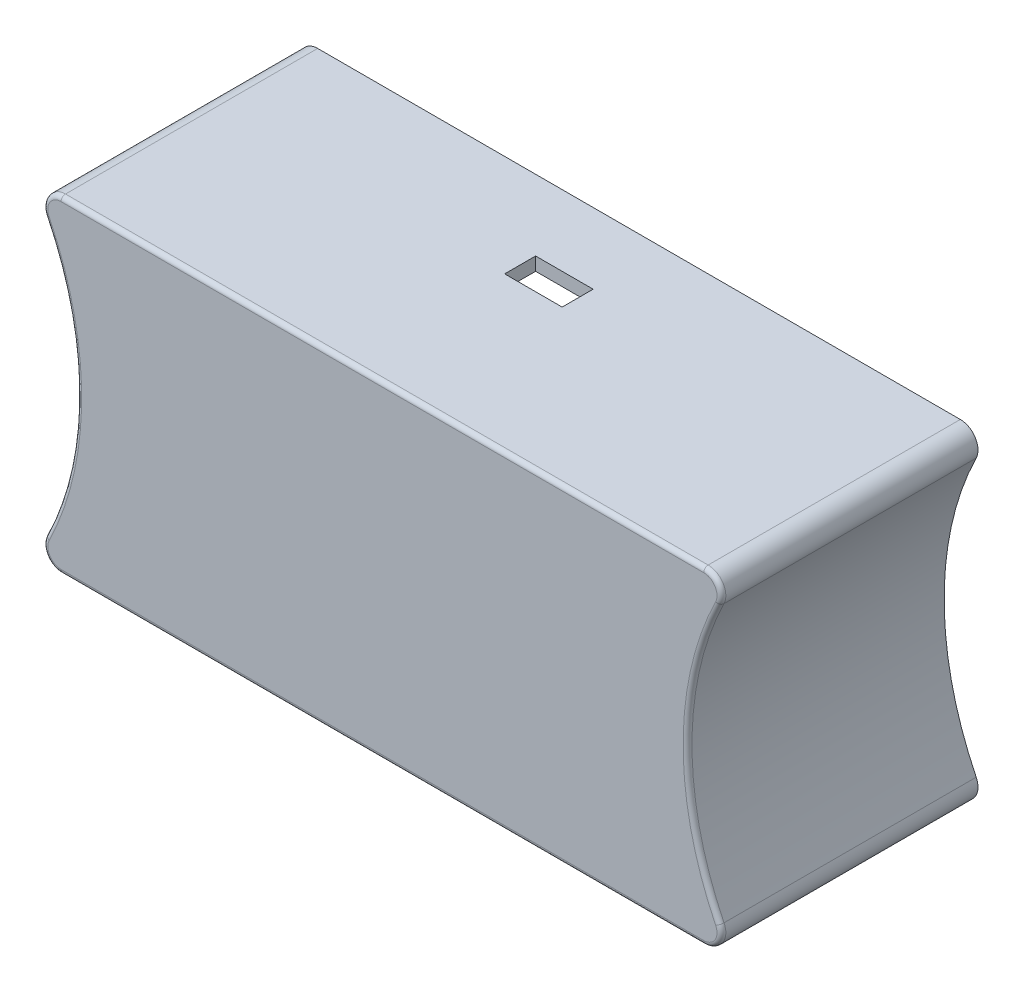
ISO-10303-21;
HEADER;
FILE_DESCRIPTION(('STEP AP214'),'2;1');
FILE_NAME('part.step','',(''),(''),'','','');
FILE_SCHEMA(('AUTOMOTIVE_DESIGN { 1 0 10303 214 1 1 1 1 }'));
ENDSEC;
DATA;
#1=APPLICATION_CONTEXT('core data for automotive mechanical design processes');
#2=APPLICATION_PROTOCOL_DEFINITION('international standard','automotive_design',2000,#1);
#3=PRODUCT_CONTEXT('',#1,'mechanical');
#4=PRODUCT('Part','Part','',(#3));
#5=PRODUCT_RELATED_PRODUCT_CATEGORY('part','',(#4));
#6=PRODUCT_DEFINITION_FORMATION('','',#4);
#7=PRODUCT_DEFINITION_CONTEXT('part definition',#1,'design');
#8=PRODUCT_DEFINITION('design','',#6,#7);
#9=PRODUCT_DEFINITION_SHAPE('','',#8);
#10=(LENGTH_UNIT() NAMED_UNIT(*) SI_UNIT(.MILLI.,.METRE.));
#11=(NAMED_UNIT(*) PLANE_ANGLE_UNIT() SI_UNIT($,.RADIAN.));
#12=(NAMED_UNIT(*) SI_UNIT($,.STERADIAN.) SOLID_ANGLE_UNIT());
#13=UNCERTAINTY_MEASURE_WITH_UNIT(LENGTH_MEASURE(1.E-05),#10,'distance_accuracy_value','');
#14=(GEOMETRIC_REPRESENTATION_CONTEXT(3) GLOBAL_UNCERTAINTY_ASSIGNED_CONTEXT((#13)) GLOBAL_UNIT_ASSIGNED_CONTEXT((#10,
#11,#12)) REPRESENTATION_CONTEXT('',''));
#15=CARTESIAN_POINT('',(0.,0.,0.));
#16=DIRECTION('',(0.,0.,1.));
#17=DIRECTION('',(1.,0.,0.));
#18=AXIS2_PLACEMENT_3D('',#15,#16,#17);
#19=CARTESIAN_POINT('',(72.6340015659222,37.,3.));
#20=DIRECTION('',(0.,-1.,0.));
#21=DIRECTION('',(0.,0.,-1.));
#22=AXIS2_PLACEMENT_3D('',#19,#20,#21);
#23=PLANE('',#22);
#24=DIRECTION('',(-1.,0.,0.));
#25=VECTOR('',#24,1.);
#26=CARTESIAN_POINT('',(5.63400156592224,37.,-39.));
#27=LINE('',#26,#25);
#28=CARTESIAN_POINT('',(5.63400156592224,37.,-39.));
#29=VERTEX_POINT('',#28);
#30=CARTESIAN_POINT('',(-7.36599843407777,37.,-39.));
#31=VERTEX_POINT('',#30);
#32=EDGE_CURVE('E217',#29,#31,#27,.T.);
#33=ORIENTED_EDGE('',*,*,#32,.F.);
#34=DIRECTION('',(0.,0.,-1.));
#35=VECTOR('',#34,1.);
#36=CARTESIAN_POINT('',(5.63400156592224,37.,-32.));
#37=LINE('',#36,#35);
#38=CARTESIAN_POINT('',(5.63400156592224,37.,-32.));
#39=VERTEX_POINT('',#38);
#40=EDGE_CURVE('E59',#39,#29,#37,.T.);
#41=ORIENTED_EDGE('',*,*,#40,.F.);
#42=DIRECTION('',(1.,0.,0.));
#43=VECTOR('',#42,1.);
#44=CARTESIAN_POINT('',(-7.36599843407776,37.,-32.));
#45=LINE('',#44,#43);
#46=CARTESIAN_POINT('',(-7.36599843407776,37.,-32.));
#47=VERTEX_POINT('',#46);
#48=EDGE_CURVE('E224',#47,#39,#45,.T.);
#49=ORIENTED_EDGE('',*,*,#48,.F.);
#50=DIRECTION('',(0.,0.,1.));
#51=VECTOR('',#50,1.);
#52=CARTESIAN_POINT('',(-7.36599843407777,37.,-39.));
#53=LINE('',#52,#51);
#54=EDGE_CURVE('E207',#31,#47,#53,.T.);
#55=ORIENTED_EDGE('',*,*,#54,.F.);
#56=EDGE_LOOP('',(#33,#41,#49,#55));
#57=FACE_BOUND('',#56,.T.);
#58=DIRECTION('',(0.,0.,-1.));
#59=VECTOR('',#58,1.);
#60=CARTESIAN_POINT('',(-72.6340015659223,37.,3.));
#61=LINE('',#60,#59);
#62=CARTESIAN_POINT('',(-72.6340015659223,37.,2.));
#63=VERTEX_POINT('',#62);
#64=CARTESIAN_POINT('',(-72.6340015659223,37.,-55.));
#65=VERTEX_POINT('',#64);
#66=EDGE_CURVE('E376',#63,#65,#61,.T.);
#67=ORIENTED_EDGE('',*,*,#66,.F.);
#68=DIRECTION('',(-1.,0.,0.));
#69=VECTOR('',#68,1.);
#70=CARTESIAN_POINT('',(72.6340015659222,37.,2.));
#71=LINE('',#70,#69);
#72=CARTESIAN_POINT('',(72.6340015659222,37.,2.));
#73=VERTEX_POINT('',#72);
#74=EDGE_CURVE('E426',#63,#73,#71,.F.);
#75=ORIENTED_EDGE('',*,*,#74,.T.);
#76=DIRECTION('',(0.,0.,-1.));
#77=VECTOR('',#76,1.);
#78=CARTESIAN_POINT('',(72.6340015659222,37.,3.));
#79=LINE('',#78,#77);
#80=CARTESIAN_POINT('',(72.6340015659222,37.,-55.));
#81=VERTEX_POINT('',#80);
#82=EDGE_CURVE('E355',#73,#81,#79,.T.);
#83=ORIENTED_EDGE('',*,*,#82,.T.);
#84=DIRECTION('',(-1.,0.,0.));
#85=VECTOR('',#84,1.);
#86=CARTESIAN_POINT('',(72.6340015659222,37.,-55.));
#87=LINE('',#86,#85);
#88=EDGE_CURVE('E247',#81,#65,#87,.T.);
#89=ORIENTED_EDGE('',*,*,#88,.T.);
#90=EDGE_LOOP('',(#67,#75,#83,#89));
#91=FACE_BOUND('',#90,.T.);
#92=ADVANCED_FACE('F43',(#57,#91),#23,.F.);
#93=CARTESIAN_POINT('',(-72.6340015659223,33.,3.));
#94=DIRECTION('',(0.,0.,-1.));
#95=DIRECTION('',(-1.,0.,0.));
#96=AXIS2_PLACEMENT_3D('',#93,#94,#95);
#97=CYLINDRICAL_SURFACE('',#96,3.99999999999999);
#98=DIRECTION('',(0.,0.,-1.));
#99=VECTOR('',#98,1.);
#100=CARTESIAN_POINT('',(-76.2253313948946,31.2386510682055,3.));
#101=LINE('',#100,#99);
#102=CARTESIAN_POINT('',(-76.2253313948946,31.2386510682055,2.));
#103=VERTEX_POINT('',#102);
#104=CARTESIAN_POINT('',(-76.2253313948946,31.2386510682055,-55.));
#105=VERTEX_POINT('',#104);
#106=EDGE_CURVE('E373',#103,#105,#101,.T.);
#107=ORIENTED_EDGE('',*,*,#106,.F.);
#108=CARTESIAN_POINT('',(-72.6340015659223,33.,2.));
#109=DIRECTION('',(0.,0.,1.));
#110=DIRECTION('',(1.,0.,0.));
#111=AXIS2_PLACEMENT_3D('',#108,#109,#110);
#112=CIRCLE('',#111,3.99999999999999);
#113=EDGE_CURVE('E423',#103,#63,#112,.F.);
#114=ORIENTED_EDGE('',*,*,#113,.T.);
#115=ORIENTED_EDGE('',*,*,#66,.T.);
#116=CARTESIAN_POINT('',(-72.6340015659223,33.,-55.));
#117=DIRECTION('',(0.,0.,1.));
#118=DIRECTION('',(1.,0.,0.));
#119=AXIS2_PLACEMENT_3D('',#116,#117,#118);
#120=CIRCLE('',#119,3.99999999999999);
#121=EDGE_CURVE('E327',#65,#105,#120,.T.);
#122=ORIENTED_EDGE('',*,*,#121,.T.);
#123=EDGE_LOOP('',(#107,#114,#115,#122));
#124=FACE_BOUND('',#123,.T.);
#125=ADVANCED_FACE('F486',(#124),#97,.T.);
#126=CARTESIAN_POINT('',(-139.919865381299,0.,3.));
#127=DIRECTION('',(0.,0.,-1.));
#128=DIRECTION('',(-1.,0.,0.));
#129=AXIS2_PLACEMENT_3D('',#126,#127,#128);
#130=CYLINDRICAL_SURFACE('',#129,70.942561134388);
#131=DIRECTION('',(0.,0.,-1.));
#132=VECTOR('',#131,1.);
#133=CARTESIAN_POINT('',(-76.2253313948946,-31.2386510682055,3.));
#134=LINE('',#133,#132);
#135=CARTESIAN_POINT('',(-76.2253313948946,-31.2386510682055,2.));
#136=VERTEX_POINT('',#135);
#137=CARTESIAN_POINT('',(-76.2253313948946,-31.2386510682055,-55.));
#138=VERTEX_POINT('',#137);
#139=EDGE_CURVE('E370',#136,#138,#134,.T.);
#140=ORIENTED_EDGE('',*,*,#139,.F.);
#141=CARTESIAN_POINT('',(-139.919865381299,0.,2.));
#142=DIRECTION('',(0.,0.,1.));
#143=DIRECTION('',(1.,0.,0.));
#144=AXIS2_PLACEMENT_3D('',#141,#142,#143);
#145=CIRCLE('',#144,70.942561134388);
#146=EDGE_CURVE('E420',#136,#103,#145,.T.);
#147=ORIENTED_EDGE('',*,*,#146,.T.);
#148=ORIENTED_EDGE('',*,*,#106,.T.);
#149=CARTESIAN_POINT('',(-139.919865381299,0.,-55.));
#150=DIRECTION('',(0.,0.,1.));
#151=DIRECTION('',(1.,0.,0.));
#152=AXIS2_PLACEMENT_3D('',#149,#150,#151);
#153=CIRCLE('',#152,70.942561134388);
#154=EDGE_CURVE('E331',#138,#105,#153,.T.);
#155=ORIENTED_EDGE('',*,*,#154,.F.);
#156=EDGE_LOOP('',(#140,#147,#148,#155));
#157=FACE_BOUND('',#156,.T.);
#158=ADVANCED_FACE('F491',(#157),#130,.F.);
#159=CARTESIAN_POINT('',(-72.6340015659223,-33.,3.));
#160=DIRECTION('',(0.,0.,-1.));
#161=DIRECTION('',(-1.,0.,0.));
#162=AXIS2_PLACEMENT_3D('',#159,#160,#161);
#163=CYLINDRICAL_SURFACE('',#162,3.99999999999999);
#164=DIRECTION('',(0.,0.,-1.));
#165=VECTOR('',#164,1.);
#166=CARTESIAN_POINT('',(-72.6340015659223,-37.,3.));
#167=LINE('',#166,#165);
#168=CARTESIAN_POINT('',(-72.6340015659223,-37.,2.));
#169=VERTEX_POINT('',#168);
#170=CARTESIAN_POINT('',(-72.6340015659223,-37.,-55.));
#171=VERTEX_POINT('',#170);
#172=EDGE_CURVE('E367',#169,#171,#167,.T.);
#173=ORIENTED_EDGE('',*,*,#172,.F.);
#174=CARTESIAN_POINT('',(-72.6340015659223,-33.,2.));
#175=DIRECTION('',(0.,0.,1.));
#176=DIRECTION('',(1.,0.,0.));
#177=AXIS2_PLACEMENT_3D('',#174,#175,#176);
#178=CIRCLE('',#177,3.99999999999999);
#179=EDGE_CURVE('E417',#169,#136,#178,.F.);
#180=ORIENTED_EDGE('',*,*,#179,.T.);
#181=ORIENTED_EDGE('',*,*,#139,.T.);
#182=CARTESIAN_POINT('',(-72.6340015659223,-33.,-55.));
#183=DIRECTION('',(0.,0.,1.));
#184=DIRECTION('',(1.,0.,0.));
#185=AXIS2_PLACEMENT_3D('',#182,#183,#184);
#186=CIRCLE('',#185,3.99999999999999);
#187=EDGE_CURVE('E335',#138,#171,#186,.T.);
#188=ORIENTED_EDGE('',*,*,#187,.T.);
#189=EDGE_LOOP('',(#173,#180,#181,#188));
#190=FACE_BOUND('',#189,.T.);
#191=ADVANCED_FACE('F533',(#190),#163,.T.);
#192=CARTESIAN_POINT('',(-72.6340015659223,-37.,3.));
#193=DIRECTION('',(0.,1.,0.));
#194=DIRECTION('',(0.,0.,1.));
#195=AXIS2_PLACEMENT_3D('',#192,#193,#194);
#196=PLANE('',#195);
#197=DIRECTION('',(0.,0.,-1.));
#198=VECTOR('',#197,1.);
#199=CARTESIAN_POINT('',(72.6340015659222,-37.,3.));
#200=LINE('',#199,#198);
#201=CARTESIAN_POINT('',(72.6340015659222,-37.,2.));
#202=VERTEX_POINT('',#201);
#203=CARTESIAN_POINT('',(72.6340015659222,-37.,-55.));
#204=VERTEX_POINT('',#203);
#205=EDGE_CURVE('E364',#202,#204,#200,.T.);
#206=ORIENTED_EDGE('',*,*,#205,.F.);
#207=DIRECTION('',(1.,0.,0.));
#208=VECTOR('',#207,1.);
#209=CARTESIAN_POINT('',(-72.6340015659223,-37.,2.));
#210=LINE('',#209,#208);
#211=EDGE_CURVE('E414',#202,#169,#210,.F.);
#212=ORIENTED_EDGE('',*,*,#211,.T.);
#213=ORIENTED_EDGE('',*,*,#172,.T.);
#214=DIRECTION('',(1.,0.,0.));
#215=VECTOR('',#214,1.);
#216=CARTESIAN_POINT('',(-72.6340015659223,-37.,-55.));
#217=LINE('',#216,#215);
#218=EDGE_CURVE('E339',#171,#204,#217,.T.);
#219=ORIENTED_EDGE('',*,*,#218,.T.);
#220=EDGE_LOOP('',(#206,#212,#213,#219));
#221=FACE_BOUND('',#220,.T.);
#222=ADVANCED_FACE('F546',(#221),#196,.F.);
#223=CARTESIAN_POINT('',(72.6340015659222,-33.,3.));
#224=DIRECTION('',(0.,0.,-1.));
#225=DIRECTION('',(-1.,0.,0.));
#226=AXIS2_PLACEMENT_3D('',#223,#224,#225);
#227=CYLINDRICAL_SURFACE('',#226,4.);
#228=DIRECTION('',(0.,0.,-1.));
#229=VECTOR('',#228,1.);
#230=CARTESIAN_POINT('',(76.2253313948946,-31.2386510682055,3.));
#231=LINE('',#230,#229);
#232=CARTESIAN_POINT('',(76.2253313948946,-31.2386510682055,2.));
#233=VERTEX_POINT('',#232);
#234=CARTESIAN_POINT('',(76.2253313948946,-31.2386510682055,-55.));
#235=VERTEX_POINT('',#234);
#236=EDGE_CURVE('E361',#233,#235,#231,.T.);
#237=ORIENTED_EDGE('',*,*,#236,.F.);
#238=CARTESIAN_POINT('',(72.6340015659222,-33.,2.));
#239=DIRECTION('',(0.,0.,1.));
#240=DIRECTION('',(1.,0.,0.));
#241=AXIS2_PLACEMENT_3D('',#238,#239,#240);
#242=CIRCLE('',#241,4.);
#243=EDGE_CURVE('E411',#233,#202,#242,.F.);
#244=ORIENTED_EDGE('',*,*,#243,.T.);
#245=ORIENTED_EDGE('',*,*,#205,.T.);
#246=CARTESIAN_POINT('',(72.6340015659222,-33.,-55.));
#247=DIRECTION('',(0.,0.,1.));
#248=DIRECTION('',(1.,0.,0.));
#249=AXIS2_PLACEMENT_3D('',#246,#247,#248);
#250=CIRCLE('',#249,4.);
#251=EDGE_CURVE('E343',#204,#235,#250,.T.);
#252=ORIENTED_EDGE('',*,*,#251,.T.);
#253=EDGE_LOOP('',(#237,#244,#245,#252));
#254=FACE_BOUND('',#253,.T.);
#255=ADVANCED_FACE('F549',(#254),#227,.T.);
#256=CARTESIAN_POINT('',(139.919865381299,0.,3.));
#257=DIRECTION('',(0.,0.,-1.));
#258=DIRECTION('',(-1.,0.,0.));
#259=AXIS2_PLACEMENT_3D('',#256,#257,#258);
#260=CYLINDRICAL_SURFACE('',#259,70.942561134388);
#261=DIRECTION('',(0.,0.,-1.));
#262=VECTOR('',#261,1.);
#263=CARTESIAN_POINT('',(76.2253313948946,31.2386510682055,3.));
#264=LINE('',#263,#262);
#265=CARTESIAN_POINT('',(76.2253313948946,31.2386510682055,2.));
#266=VERTEX_POINT('',#265);
#267=CARTESIAN_POINT('',(76.2253313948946,31.2386510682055,-55.));
#268=VERTEX_POINT('',#267);
#269=EDGE_CURVE('E358',#266,#268,#264,.T.);
#270=ORIENTED_EDGE('',*,*,#269,.F.);
#271=CARTESIAN_POINT('',(139.919865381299,0.,2.));
#272=DIRECTION('',(0.,0.,1.));
#273=DIRECTION('',(1.,0.,0.));
#274=AXIS2_PLACEMENT_3D('',#271,#272,#273);
#275=CIRCLE('',#274,70.942561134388);
#276=EDGE_CURVE('E408',#266,#233,#275,.T.);
#277=ORIENTED_EDGE('',*,*,#276,.T.);
#278=ORIENTED_EDGE('',*,*,#236,.T.);
#279=CARTESIAN_POINT('',(139.919865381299,0.,-55.));
#280=DIRECTION('',(0.,0.,1.));
#281=DIRECTION('',(1.,0.,0.));
#282=AXIS2_PLACEMENT_3D('',#279,#280,#281);
#283=CIRCLE('',#282,70.942561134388);
#284=EDGE_CURVE('E347',#268,#235,#283,.T.);
#285=ORIENTED_EDGE('',*,*,#284,.F.);
#286=EDGE_LOOP('',(#270,#277,#278,#285));
#287=FACE_BOUND('',#286,.T.);
#288=ADVANCED_FACE('F574',(#287),#260,.F.);
#289=CARTESIAN_POINT('',(72.6340015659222,33.,3.));
#290=DIRECTION('',(0.,0.,-1.));
#291=DIRECTION('',(-1.,0.,0.));
#292=AXIS2_PLACEMENT_3D('',#289,#290,#291);
#293=CYLINDRICAL_SURFACE('',#292,4.);
#294=ORIENTED_EDGE('',*,*,#82,.F.);
#295=CARTESIAN_POINT('',(72.6340015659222,33.,2.));
#296=DIRECTION('',(0.,0.,1.));
#297=DIRECTION('',(1.,0.,0.));
#298=AXIS2_PLACEMENT_3D('',#295,#296,#297);
#299=CIRCLE('',#298,4.);
#300=EDGE_CURVE('E404',#73,#266,#299,.F.);
#301=ORIENTED_EDGE('',*,*,#300,.T.);
#302=ORIENTED_EDGE('',*,*,#269,.T.);
#303=CARTESIAN_POINT('',(72.6340015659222,33.,-55.));
#304=DIRECTION('',(0.,0.,1.));
#305=DIRECTION('',(1.,0.,0.));
#306=AXIS2_PLACEMENT_3D('',#303,#304,#305);
#307=CIRCLE('',#306,4.);
#308=EDGE_CURVE('E351',#268,#81,#307,.T.);
#309=ORIENTED_EDGE('',*,*,#308,.T.);
#310=EDGE_LOOP('',(#294,#301,#302,#309));
#311=FACE_BOUND('',#310,.T.);
#312=ADVANCED_FACE('F569',(#311),#293,.T.);
#313=CARTESIAN_POINT('',(-72.6340015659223,33.,3.));
#314=DIRECTION('',(0.,0.,1.));
#315=DIRECTION('',(1.,0.,0.));
#316=AXIS2_PLACEMENT_3D('',#313,#314,#315);
#317=PLANE('',#316);
#318=CARTESIAN_POINT('',(139.919865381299,0.,3.));
#319=DIRECTION('',(0.,0.,1.));
#320=DIRECTION('',(1.,0.,0.));
#321=AXIS2_PLACEMENT_3D('',#318,#319,#320);
#322=CIRCLE('',#321,71.942561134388);
#323=CARTESIAN_POINT('',(75.3274989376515,-31.6789883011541,3.));
#324=VERTEX_POINT('',#323);
#325=CARTESIAN_POINT('',(75.3274989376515,31.6789883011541,3.));
#326=VERTEX_POINT('',#325);
#327=EDGE_CURVE('E397',#324,#326,#322,.F.);
#328=ORIENTED_EDGE('',*,*,#327,.T.);
#329=CARTESIAN_POINT('',(72.6340015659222,33.,3.));
#330=DIRECTION('',(0.,0.,1.));
#331=DIRECTION('',(1.,0.,0.));
#332=AXIS2_PLACEMENT_3D('',#329,#330,#331);
#333=CIRCLE('',#332,3.);
#334=CARTESIAN_POINT('',(72.6340015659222,36.,3.));
#335=VERTEX_POINT('',#334);
#336=EDGE_CURVE('E400',#326,#335,#333,.T.);
#337=ORIENTED_EDGE('',*,*,#336,.T.);
#338=DIRECTION('',(-1.,0.,0.));
#339=VECTOR('',#338,1.);
#340=CARTESIAN_POINT('',(-72.6340015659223,36.,3.));
#341=LINE('',#340,#339);
#342=CARTESIAN_POINT('',(-72.6340015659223,36.,3.));
#343=VERTEX_POINT('',#342);
#344=EDGE_CURVE('E379',#335,#343,#341,.T.);
#345=ORIENTED_EDGE('',*,*,#344,.T.);
#346=CARTESIAN_POINT('',(-72.6340015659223,33.,3.));
#347=DIRECTION('',(0.,0.,1.));
#348=DIRECTION('',(1.,0.,0.));
#349=AXIS2_PLACEMENT_3D('',#346,#347,#348);
#350=CIRCLE('',#349,2.99999999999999);
#351=CARTESIAN_POINT('',(-75.3274989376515,31.6789883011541,3.));
#352=VERTEX_POINT('',#351);
#353=EDGE_CURVE('E382',#343,#352,#350,.T.);
#354=ORIENTED_EDGE('',*,*,#353,.T.);
#355=CARTESIAN_POINT('',(-139.919865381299,0.,3.));
#356=DIRECTION('',(0.,0.,1.));
#357=DIRECTION('',(1.,0.,0.));
#358=AXIS2_PLACEMENT_3D('',#355,#356,#357);
#359=CIRCLE('',#358,71.942561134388);
#360=CARTESIAN_POINT('',(-75.3274989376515,-31.6789883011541,3.));
#361=VERTEX_POINT('',#360);
#362=EDGE_CURVE('E385',#352,#361,#359,.F.);
#363=ORIENTED_EDGE('',*,*,#362,.T.);
#364=CARTESIAN_POINT('',(-72.6340015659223,-33.,3.));
#365=DIRECTION('',(0.,0.,1.));
#366=DIRECTION('',(1.,0.,0.));
#367=AXIS2_PLACEMENT_3D('',#364,#365,#366);
#368=CIRCLE('',#367,2.99999999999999);
#369=CARTESIAN_POINT('',(-72.6340015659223,-36.,3.));
#370=VERTEX_POINT('',#369);
#371=EDGE_CURVE('E388',#361,#370,#368,.T.);
#372=ORIENTED_EDGE('',*,*,#371,.T.);
#373=DIRECTION('',(1.,0.,0.));
#374=VECTOR('',#373,1.);
#375=CARTESIAN_POINT('',(72.6340015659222,-36.,3.));
#376=LINE('',#375,#374);
#377=CARTESIAN_POINT('',(72.6340015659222,-36.,3.));
#378=VERTEX_POINT('',#377);
#379=EDGE_CURVE('E391',#370,#378,#376,.T.);
#380=ORIENTED_EDGE('',*,*,#379,.T.);
#381=CARTESIAN_POINT('',(72.6340015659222,-33.,3.));
#382=DIRECTION('',(0.,0.,1.));
#383=DIRECTION('',(1.,0.,0.));
#384=AXIS2_PLACEMENT_3D('',#381,#382,#383);
#385=CIRCLE('',#384,3.);
#386=EDGE_CURVE('E394',#378,#324,#385,.T.);
#387=ORIENTED_EDGE('',*,*,#386,.T.);
#388=EDGE_LOOP('',(#328,#337,#345,#354,#363,#372,#380,#387));
#389=FACE_BOUND('',#388,.T.);
#390=ADVANCED_FACE('F558',(#389),#317,.T.);
#391=CARTESIAN_POINT('',(-72.6340015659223,33.,-55.));
#392=DIRECTION('',(0.,0.,1.));
#393=DIRECTION('',(1.,0.,0.));
#394=AXIS2_PLACEMENT_3D('',#391,#392,#393);
#395=PLANE('',#394);
#396=CARTESIAN_POINT('',(72.6340015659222,33.,-55.));
#397=DIRECTION('',(0.,0.,1.));
#398=DIRECTION('',(1.,0.,0.));
#399=AXIS2_PLACEMENT_3D('',#396,#397,#398);
#400=CIRCLE('',#399,1.);
#401=CARTESIAN_POINT('',(73.5318340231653,32.5596627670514,-55.));
#402=VERTEX_POINT('',#401);
#403=CARTESIAN_POINT('',(72.6340015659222,34.,-55.));
#404=VERTEX_POINT('',#403);
#405=EDGE_CURVE('E254',#402,#404,#400,.T.);
#406=ORIENTED_EDGE('',*,*,#405,.T.);
#407=DIRECTION('',(-1.,0.,0.));
#408=VECTOR('',#407,1.);
#409=CARTESIAN_POINT('',(72.6340015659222,34.,-55.));
#410=LINE('',#409,#408);
#411=CARTESIAN_POINT('',(-72.6340015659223,34.,-55.));
#412=VERTEX_POINT('',#411);
#413=EDGE_CURVE('E293',#404,#412,#410,.T.);
#414=ORIENTED_EDGE('',*,*,#413,.T.);
#415=CARTESIAN_POINT('',(-72.6340015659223,33.,-55.));
#416=DIRECTION('',(0.,0.,1.));
#417=DIRECTION('',(1.,0.,0.));
#418=AXIS2_PLACEMENT_3D('',#415,#416,#417);
#419=CIRCLE('',#418,0.999999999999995);
#420=CARTESIAN_POINT('',(-73.5318340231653,32.5596627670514,-55.));
#421=VERTEX_POINT('',#420);
#422=EDGE_CURVE('E297',#412,#421,#419,.T.);
#423=ORIENTED_EDGE('',*,*,#422,.T.);
#424=CARTESIAN_POINT('',(-139.919865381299,0.,-55.));
#425=DIRECTION('',(0.,0.,1.));
#426=DIRECTION('',(1.,0.,0.));
#427=AXIS2_PLACEMENT_3D('',#424,#425,#426);
#428=CIRCLE('',#427,73.942561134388);
#429=CARTESIAN_POINT('',(-73.5318340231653,-32.5596627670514,-55.));
#430=VERTEX_POINT('',#429);
#431=EDGE_CURVE('E318',#430,#421,#428,.T.);
#432=ORIENTED_EDGE('',*,*,#431,.F.);
#433=CARTESIAN_POINT('',(-72.6340015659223,-33.,-55.));
#434=DIRECTION('',(0.,0.,1.));
#435=DIRECTION('',(1.,0.,0.));
#436=AXIS2_PLACEMENT_3D('',#433,#434,#435);
#437=CIRCLE('',#436,0.999999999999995);
#438=CARTESIAN_POINT('',(-72.6340015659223,-34.,-55.));
#439=VERTEX_POINT('',#438);
#440=EDGE_CURVE('E314',#430,#439,#437,.T.);
#441=ORIENTED_EDGE('',*,*,#440,.T.);
#442=DIRECTION('',(1.,0.,0.));
#443=VECTOR('',#442,1.);
#444=CARTESIAN_POINT('',(-72.6340015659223,-34.,-55.));
#445=LINE('',#444,#443);
#446=CARTESIAN_POINT('',(72.6340015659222,-34.,-55.));
#447=VERTEX_POINT('',#446);
#448=EDGE_CURVE('E310',#439,#447,#445,.T.);
#449=ORIENTED_EDGE('',*,*,#448,.T.);
#450=CARTESIAN_POINT('',(72.6340015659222,-33.,-55.));
#451=DIRECTION('',(0.,0.,1.));
#452=DIRECTION('',(1.,0.,0.));
#453=AXIS2_PLACEMENT_3D('',#450,#451,#452);
#454=CIRCLE('',#453,0.999999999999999);
#455=CARTESIAN_POINT('',(73.5318340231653,-32.5596627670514,-55.));
#456=VERTEX_POINT('',#455);
#457=EDGE_CURVE('E306',#447,#456,#454,.T.);
#458=ORIENTED_EDGE('',*,*,#457,.T.);
#459=CARTESIAN_POINT('',(139.919865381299,0.,-55.));
#460=DIRECTION('',(0.,0.,1.));
#461=DIRECTION('',(1.,0.,0.));
#462=AXIS2_PLACEMENT_3D('',#459,#460,#461);
#463=CIRCLE('',#462,73.942561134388);
#464=EDGE_CURVE('E302',#402,#456,#463,.T.);
#465=ORIENTED_EDGE('',*,*,#464,.F.);
#466=EDGE_LOOP('',(#406,#414,#423,#432,#441,#449,#458,#465));
#467=FACE_BOUND('',#466,.T.);
#468=ORIENTED_EDGE('',*,*,#88,.F.);
#469=ORIENTED_EDGE('',*,*,#308,.F.);
#470=ORIENTED_EDGE('',*,*,#284,.T.);
#471=ORIENTED_EDGE('',*,*,#251,.F.);
#472=ORIENTED_EDGE('',*,*,#218,.F.);
#473=ORIENTED_EDGE('',*,*,#187,.F.);
#474=ORIENTED_EDGE('',*,*,#154,.T.);
#475=ORIENTED_EDGE('',*,*,#121,.F.);
#476=EDGE_LOOP('',(#468,#469,#470,#471,#472,#473,#474,#475));
#477=FACE_BOUND('',#476,.T.);
#478=ADVANCED_FACE('F542',(#467,#477),#395,.F.);
#479=CARTESIAN_POINT('',(72.6340015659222,34.,3.));
#480=DIRECTION('',(0.,-1.,0.));
#481=DIRECTION('',(0.,0.,-1.));
#482=AXIS2_PLACEMENT_3D('',#479,#480,#481);
#483=PLANE('',#482);
#484=DIRECTION('',(0.,0.,1.));
#485=VECTOR('',#484,1.);
#486=CARTESIAN_POINT('',(5.63400156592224,34.,3.00000000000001));
#487=LINE('',#486,#485);
#488=CARTESIAN_POINT('',(5.63400156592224,34.,-39.));
#489=VERTEX_POINT('',#488);
#490=CARTESIAN_POINT('',(5.63400156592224,34.,-32.));
#491=VERTEX_POINT('',#490);
#492=EDGE_CURVE('E11',#489,#491,#487,.T.);
#493=ORIENTED_EDGE('',*,*,#492,.F.);
#494=DIRECTION('',(1.,0.,0.));
#495=VECTOR('',#494,1.);
#496=CARTESIAN_POINT('',(72.6340015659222,34.,-39.));
#497=LINE('',#496,#495);
#498=CARTESIAN_POINT('',(-7.36599843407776,34.,-39.));
#499=VERTEX_POINT('',#498);
#500=EDGE_CURVE('E429',#499,#489,#497,.T.);
#501=ORIENTED_EDGE('',*,*,#500,.F.);
#502=DIRECTION('',(0.,0.,-1.));
#503=VECTOR('',#502,1.);
#504=CARTESIAN_POINT('',(-7.36599843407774,34.,3.00000000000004));
#505=LINE('',#504,#503);
#506=CARTESIAN_POINT('',(-7.36599843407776,34.,-32.));
#507=VERTEX_POINT('',#506);
#508=EDGE_CURVE('E210',#507,#499,#505,.T.);
#509=ORIENTED_EDGE('',*,*,#508,.F.);
#510=DIRECTION('',(-1.,0.,0.));
#511=VECTOR('',#510,1.);
#512=CARTESIAN_POINT('',(72.6340015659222,34.,-32.));
#513=LINE('',#512,#511);
#514=EDGE_CURVE('E52',#491,#507,#513,.T.);
#515=ORIENTED_EDGE('',*,*,#514,.F.);
#516=EDGE_LOOP('',(#493,#501,#509,#515));
#517=FACE_BOUND('',#516,.T.);
#518=DIRECTION('',(0.,0.,-1.));
#519=VECTOR('',#518,1.);
#520=CARTESIAN_POINT('',(72.6340015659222,34.,3.));
#521=LINE('',#520,#519);
#522=CARTESIAN_POINT('',(72.6340015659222,34.,0.));
#523=VERTEX_POINT('',#522);
#524=EDGE_CURVE('E239',#523,#404,#521,.T.);
#525=ORIENTED_EDGE('',*,*,#524,.F.);
#526=DIRECTION('',(-1.,0.,0.));
#527=VECTOR('',#526,1.);
#528=CARTESIAN_POINT('',(72.6340015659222,34.,0.));
#529=LINE('',#528,#527);
#530=CARTESIAN_POINT('',(-72.6340015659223,34.,0.));
#531=VERTEX_POINT('',#530);
#532=EDGE_CURVE('E249',#523,#531,#529,.T.);
#533=ORIENTED_EDGE('',*,*,#532,.T.);
#534=DIRECTION('',(0.,0.,-1.));
#535=VECTOR('',#534,1.);
#536=CARTESIAN_POINT('',(-72.6340015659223,34.,3.));
#537=LINE('',#536,#535);
#538=EDGE_CURVE('E244',#531,#412,#537,.T.);
#539=ORIENTED_EDGE('',*,*,#538,.T.);
#540=ORIENTED_EDGE('',*,*,#413,.F.);
#541=EDGE_LOOP('',(#525,#533,#539,#540));
#542=FACE_BOUND('',#541,.T.);
#543=ADVANCED_FACE('F468',(#517,#542),#483,.T.);
#544=CARTESIAN_POINT('',(-72.6340015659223,33.,3.));
#545=DIRECTION('',(0.,0.,-1.));
#546=DIRECTION('',(-1.,0.,0.));
#547=AXIS2_PLACEMENT_3D('',#544,#545,#546);
#548=CYLINDRICAL_SURFACE('',#547,0.999999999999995);
#549=ORIENTED_EDGE('',*,*,#538,.F.);
#550=CARTESIAN_POINT('',(-72.6340015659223,33.,0.));
#551=DIRECTION('',(0.,0.,1.));
#552=DIRECTION('',(1.,0.,0.));
#553=AXIS2_PLACEMENT_3D('',#550,#551,#552);
#554=CIRCLE('',#553,0.999999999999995);
#555=CARTESIAN_POINT('',(-73.5318340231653,32.5596627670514,0.));
#556=VERTEX_POINT('',#555);
#557=EDGE_CURVE('E253',#531,#556,#554,.T.);
#558=ORIENTED_EDGE('',*,*,#557,.T.);
#559=DIRECTION('',(0.,0.,-1.));
#560=VECTOR('',#559,1.);
#561=CARTESIAN_POINT('',(-73.5318340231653,32.5596627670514,3.));
#562=LINE('',#561,#560);
#563=EDGE_CURVE('E248',#556,#421,#562,.T.);
#564=ORIENTED_EDGE('',*,*,#563,.T.);
#565=ORIENTED_EDGE('',*,*,#422,.F.);
#566=EDGE_LOOP('',(#549,#558,#564,#565));
#567=FACE_BOUND('',#566,.T.);
#568=ADVANCED_FACE('F699',(#567),#548,.F.);
#569=CARTESIAN_POINT('',(-139.919865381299,0.,3.));
#570=DIRECTION('',(0.,0.,-1.));
#571=DIRECTION('',(-1.,0.,0.));
#572=AXIS2_PLACEMENT_3D('',#569,#570,#571);
#573=CYLINDRICAL_SURFACE('',#572,73.942561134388);
#574=ORIENTED_EDGE('',*,*,#563,.F.);
#575=CARTESIAN_POINT('',(-139.919865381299,0.,0.));
#576=DIRECTION('',(0.,0.,1.));
#577=DIRECTION('',(1.,0.,0.));
#578=AXIS2_PLACEMENT_3D('',#575,#576,#577);
#579=CIRCLE('',#578,73.942561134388);
#580=CARTESIAN_POINT('',(-73.5318340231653,-32.5596627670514,0.));
#581=VERTEX_POINT('',#580);
#582=EDGE_CURVE('E261',#581,#556,#579,.T.);
#583=ORIENTED_EDGE('',*,*,#582,.F.);
#584=DIRECTION('',(0.,0.,-1.));
#585=VECTOR('',#584,1.);
#586=CARTESIAN_POINT('',(-73.5318340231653,-32.5596627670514,3.));
#587=LINE('',#586,#585);
#588=EDGE_CURVE('E258',#581,#430,#587,.T.);
#589=ORIENTED_EDGE('',*,*,#588,.T.);
#590=ORIENTED_EDGE('',*,*,#431,.T.);
#591=EDGE_LOOP('',(#574,#583,#589,#590));
#592=FACE_BOUND('',#591,.T.);
#593=ADVANCED_FACE('F799',(#592),#573,.T.);
#594=CARTESIAN_POINT('',(-72.6340015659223,-33.,3.));
#595=DIRECTION('',(0.,0.,-1.));
#596=DIRECTION('',(-1.,0.,0.));
#597=AXIS2_PLACEMENT_3D('',#594,#595,#596);
#598=CYLINDRICAL_SURFACE('',#597,0.999999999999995);
#599=ORIENTED_EDGE('',*,*,#588,.F.);
#600=CARTESIAN_POINT('',(-72.6340015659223,-33.,0.));
#601=DIRECTION('',(0.,0.,1.));
#602=DIRECTION('',(1.,0.,0.));
#603=AXIS2_PLACEMENT_3D('',#600,#601,#602);
#604=CIRCLE('',#603,0.999999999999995);
#605=CARTESIAN_POINT('',(-72.6340015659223,-34.,0.));
#606=VERTEX_POINT('',#605);
#607=EDGE_CURVE('E268',#581,#606,#604,.T.);
#608=ORIENTED_EDGE('',*,*,#607,.T.);
#609=DIRECTION('',(0.,0.,1.));
#610=VECTOR('',#609,1.);
#611=CARTESIAN_POINT('',(-72.6340015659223,-34.,3.));
#612=LINE('',#611,#610);
#613=EDGE_CURVE('E264',#606,#439,#612,.F.);
#614=ORIENTED_EDGE('',*,*,#613,.T.);
#615=ORIENTED_EDGE('',*,*,#440,.F.);
#616=EDGE_LOOP('',(#599,#608,#614,#615));
#617=FACE_BOUND('',#616,.T.);
#618=ADVANCED_FACE('F789',(#617),#598,.F.);
#619=CARTESIAN_POINT('',(-72.6340015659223,-34.,3.));
#620=DIRECTION('',(0.,1.,0.));
#621=DIRECTION('',(0.,0.,1.));
#622=AXIS2_PLACEMENT_3D('',#619,#620,#621);
#623=PLANE('',#622);
#624=ORIENTED_EDGE('',*,*,#613,.F.);
#625=DIRECTION('',(1.,0.,0.));
#626=VECTOR('',#625,1.);
#627=CARTESIAN_POINT('',(-72.6340015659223,-34.,0.));
#628=LINE('',#627,#626);
#629=CARTESIAN_POINT('',(72.6340015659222,-34.,0.));
#630=VERTEX_POINT('',#629);
#631=EDGE_CURVE('E274',#606,#630,#628,.T.);
#632=ORIENTED_EDGE('',*,*,#631,.T.);
#633=DIRECTION('',(0.,0.,-1.));
#634=VECTOR('',#633,1.);
#635=CARTESIAN_POINT('',(72.6340015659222,-34.,3.));
#636=LINE('',#635,#634);
#637=EDGE_CURVE('E271',#630,#447,#636,.T.);
#638=ORIENTED_EDGE('',*,*,#637,.T.);
#639=ORIENTED_EDGE('',*,*,#448,.F.);
#640=EDGE_LOOP('',(#624,#632,#638,#639));
#641=FACE_BOUND('',#640,.T.);
#642=ADVANCED_FACE('F779',(#641),#623,.T.);
#643=CARTESIAN_POINT('',(72.6340015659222,-33.,3.));
#644=DIRECTION('',(0.,0.,-1.));
#645=DIRECTION('',(-1.,0.,0.));
#646=AXIS2_PLACEMENT_3D('',#643,#644,#645);
#647=CYLINDRICAL_SURFACE('',#646,0.999999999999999);
#648=ORIENTED_EDGE('',*,*,#637,.F.);
#649=CARTESIAN_POINT('',(72.6340015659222,-33.,0.));
#650=DIRECTION('',(0.,0.,1.));
#651=DIRECTION('',(1.,0.,0.));
#652=AXIS2_PLACEMENT_3D('',#649,#650,#651);
#653=CIRCLE('',#652,0.999999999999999);
#654=CARTESIAN_POINT('',(73.5318340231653,-32.5596627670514,0.));
#655=VERTEX_POINT('',#654);
#656=EDGE_CURVE('E280',#630,#655,#653,.T.);
#657=ORIENTED_EDGE('',*,*,#656,.T.);
#658=DIRECTION('',(0.,0.,-1.));
#659=VECTOR('',#658,1.);
#660=CARTESIAN_POINT('',(73.5318340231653,-32.5596627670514,3.));
#661=LINE('',#660,#659);
#662=EDGE_CURVE('E277',#655,#456,#661,.T.);
#663=ORIENTED_EDGE('',*,*,#662,.T.);
#664=ORIENTED_EDGE('',*,*,#457,.F.);
#665=EDGE_LOOP('',(#648,#657,#663,#664));
#666=FACE_BOUND('',#665,.T.);
#667=ADVANCED_FACE('F769',(#666),#647,.F.);
#668=CARTESIAN_POINT('',(139.919865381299,0.,3.));
#669=DIRECTION('',(0.,0.,-1.));
#670=DIRECTION('',(-1.,0.,0.));
#671=AXIS2_PLACEMENT_3D('',#668,#669,#670);
#672=CYLINDRICAL_SURFACE('',#671,73.942561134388);
#673=ORIENTED_EDGE('',*,*,#662,.F.);
#674=CARTESIAN_POINT('',(139.919865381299,0.,0.));
#675=DIRECTION('',(0.,0.,1.));
#676=DIRECTION('',(1.,0.,0.));
#677=AXIS2_PLACEMENT_3D('',#674,#675,#676);
#678=CIRCLE('',#677,73.942561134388);
#679=CARTESIAN_POINT('',(73.5318340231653,32.5596627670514,0.));
#680=VERTEX_POINT('',#679);
#681=EDGE_CURVE('E285',#680,#655,#678,.T.);
#682=ORIENTED_EDGE('',*,*,#681,.F.);
#683=DIRECTION('',(0.,0.,-1.));
#684=VECTOR('',#683,1.);
#685=CARTESIAN_POINT('',(73.5318340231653,32.5596627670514,3.));
#686=LINE('',#685,#684);
#687=EDGE_CURVE('E242',#680,#402,#686,.T.);
#688=ORIENTED_EDGE('',*,*,#687,.T.);
#689=ORIENTED_EDGE('',*,*,#464,.T.);
#690=EDGE_LOOP('',(#673,#682,#688,#689));
#691=FACE_BOUND('',#690,.T.);
#692=ADVANCED_FACE('F759',(#691),#672,.T.);
#693=CARTESIAN_POINT('',(72.6340015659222,33.,3.));
#694=DIRECTION('',(0.,0.,-1.));
#695=DIRECTION('',(-1.,0.,0.));
#696=AXIS2_PLACEMENT_3D('',#693,#694,#695);
#697=CYLINDRICAL_SURFACE('',#696,1.);
#698=ORIENTED_EDGE('',*,*,#687,.F.);
#699=CARTESIAN_POINT('',(72.6340015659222,33.,0.));
#700=DIRECTION('',(0.,0.,1.));
#701=DIRECTION('',(1.,0.,0.));
#702=AXIS2_PLACEMENT_3D('',#699,#700,#701);
#703=CIRCLE('',#702,1.);
#704=EDGE_CURVE('E243',#680,#523,#703,.T.);
#705=ORIENTED_EDGE('',*,*,#704,.T.);
#706=ORIENTED_EDGE('',*,*,#524,.T.);
#707=ORIENTED_EDGE('',*,*,#405,.F.);
#708=EDGE_LOOP('',(#698,#705,#706,#707));
#709=FACE_BOUND('',#708,.T.);
#710=ADVANCED_FACE('F749',(#709),#697,.F.);
#711=CARTESIAN_POINT('',(-72.6340015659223,33.,0.));
#712=DIRECTION('',(0.,0.,1.));
#713=DIRECTION('',(1.,0.,0.));
#714=AXIS2_PLACEMENT_3D('',#711,#712,#713);
#715=PLANE('',#714);
#716=ORIENTED_EDGE('',*,*,#532,.F.);
#717=ORIENTED_EDGE('',*,*,#704,.F.);
#718=ORIENTED_EDGE('',*,*,#681,.T.);
#719=ORIENTED_EDGE('',*,*,#656,.F.);
#720=ORIENTED_EDGE('',*,*,#631,.F.);
#721=ORIENTED_EDGE('',*,*,#607,.F.);
#722=ORIENTED_EDGE('',*,*,#582,.T.);
#723=ORIENTED_EDGE('',*,*,#557,.F.);
#724=EDGE_LOOP('',(#716,#717,#718,#719,#720,#721,#722,#723));
#725=FACE_BOUND('',#724,.T.);
#726=ADVANCED_FACE('F520',(#725),#715,.F.);
#727=CARTESIAN_POINT('',(-72.6340015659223,-33.,2.));
#728=DIRECTION('',(0.,0.,1.));
#729=DIRECTION('',(1.,0.,0.));
#730=AXIS2_PLACEMENT_3D('',#727,#728,#729);
#731=TOROIDAL_SURFACE('',#730,2.99999999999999,1.);
#732=CARTESIAN_POINT('',(-75.3274989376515,-31.6789883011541,2.));
#733=DIRECTION('',(0.44033723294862,0.897832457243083,0.));
#734=DIRECTION('',(-0.897832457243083,0.44033723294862,0.));
#735=AXIS2_PLACEMENT_3D('',#732,#733,#734);
#736=CIRCLE('',#735,1.);
#737=EDGE_CURVE('E451',#136,#361,#736,.T.);
#738=ORIENTED_EDGE('',*,*,#737,.F.);
#739=ORIENTED_EDGE('',*,*,#179,.F.);
#740=CARTESIAN_POINT('',(-72.6340015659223,-36.,2.));
#741=DIRECTION('',(1.,0.,0.));
#742=DIRECTION('',(0.,0.,-1.));
#743=AXIS2_PLACEMENT_3D('',#740,#741,#742);
#744=CIRCLE('',#743,1.);
#745=EDGE_CURVE('E298',#370,#169,#744,.T.);
#746=ORIENTED_EDGE('',*,*,#745,.F.);
#747=ORIENTED_EDGE('',*,*,#371,.F.);
#748=EDGE_LOOP('',(#738,#739,#746,#747));
#749=FACE_BOUND('',#748,.T.);
#750=ADVANCED_FACE('F45',(#749),#731,.T.);
#751=CARTESIAN_POINT('',(-72.6340015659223,-36.,2.));
#752=DIRECTION('',(-1.,0.,0.));
#753=DIRECTION('',(0.,0.,1.));
#754=AXIS2_PLACEMENT_3D('',#751,#752,#753);
#755=CYLINDRICAL_SURFACE('',#754,1.);
#756=ORIENTED_EDGE('',*,*,#745,.T.);
#757=ORIENTED_EDGE('',*,*,#211,.F.);
#758=CARTESIAN_POINT('',(72.6340015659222,-36.,2.));
#759=DIRECTION('',(1.,0.,0.));
#760=DIRECTION('',(0.,0.,-1.));
#761=AXIS2_PLACEMENT_3D('',#758,#759,#760);
#762=CIRCLE('',#761,1.);
#763=EDGE_CURVE('E447',#378,#202,#762,.T.);
#764=ORIENTED_EDGE('',*,*,#763,.F.);
#765=ORIENTED_EDGE('',*,*,#379,.F.);
#766=EDGE_LOOP('',(#756,#757,#764,#765));
#767=FACE_BOUND('',#766,.T.);
#768=ADVANCED_FACE('F513',(#767),#755,.T.);
#769=CARTESIAN_POINT('',(-139.919865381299,0.,2.));
#770=DIRECTION('',(0.,0.,1.));
#771=DIRECTION('',(1.,0.,0.));
#772=AXIS2_PLACEMENT_3D('',#769,#770,#771);
#773=TOROIDAL_SURFACE('',#772,71.942561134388,1.);
#774=ORIENTED_EDGE('',*,*,#737,.T.);
#775=ORIENTED_EDGE('',*,*,#362,.F.);
#776=CARTESIAN_POINT('',(-75.3274989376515,31.6789883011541,2.));
#777=DIRECTION('',(-0.440337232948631,0.897832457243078,0.));
#778=DIRECTION('',(-0.897832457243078,-0.440337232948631,0.));
#779=AXIS2_PLACEMENT_3D('',#776,#777,#778);
#780=CIRCLE('',#779,1.);
#781=EDGE_CURVE('E443',#103,#352,#780,.T.);
#782=ORIENTED_EDGE('',*,*,#781,.F.);
#783=ORIENTED_EDGE('',*,*,#146,.F.);
#784=EDGE_LOOP('',(#774,#775,#782,#783));
#785=FACE_BOUND('',#784,.T.);
#786=ADVANCED_FACE('F510',(#785),#773,.T.);
#787=CARTESIAN_POINT('',(72.6340015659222,-33.,2.));
#788=DIRECTION('',(0.,0.,1.));
#789=DIRECTION('',(1.,0.,0.));
#790=AXIS2_PLACEMENT_3D('',#787,#788,#789);
#791=TOROIDAL_SURFACE('',#790,3.,1.);
#792=ORIENTED_EDGE('',*,*,#763,.T.);
#793=ORIENTED_EDGE('',*,*,#243,.F.);
#794=CARTESIAN_POINT('',(75.3274989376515,-31.6789883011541,2.));
#795=DIRECTION('',(-0.440337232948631,0.897832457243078,0.));
#796=DIRECTION('',(-0.897832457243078,-0.440337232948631,0.));
#797=AXIS2_PLACEMENT_3D('',#794,#795,#796);
#798=CIRCLE('',#797,1.);
#799=EDGE_CURVE('E439',#324,#233,#798,.T.);
#800=ORIENTED_EDGE('',*,*,#799,.F.);
#801=ORIENTED_EDGE('',*,*,#386,.F.);
#802=EDGE_LOOP('',(#792,#793,#800,#801));
#803=FACE_BOUND('',#802,.T.);
#804=ADVANCED_FACE('F506',(#803),#791,.T.);
#805=CARTESIAN_POINT('',(-72.6340015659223,33.,2.));
#806=DIRECTION('',(0.,0.,1.));
#807=DIRECTION('',(1.,0.,0.));
#808=AXIS2_PLACEMENT_3D('',#805,#806,#807);
#809=TOROIDAL_SURFACE('',#808,2.99999999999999,1.);
#810=ORIENTED_EDGE('',*,*,#781,.T.);
#811=ORIENTED_EDGE('',*,*,#353,.F.);
#812=CARTESIAN_POINT('',(-72.6340015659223,36.,2.));
#813=DIRECTION('',(1.,0.,0.));
#814=DIRECTION('',(0.,0.,-1.));
#815=AXIS2_PLACEMENT_3D('',#812,#813,#814);
#816=CIRCLE('',#815,1.);
#817=EDGE_CURVE('E435',#63,#343,#816,.T.);
#818=ORIENTED_EDGE('',*,*,#817,.F.);
#819=ORIENTED_EDGE('',*,*,#113,.F.);
#820=EDGE_LOOP('',(#810,#811,#818,#819));
#821=FACE_BOUND('',#820,.T.);
#822=ADVANCED_FACE('F502',(#821),#809,.T.);
#823=CARTESIAN_POINT('',(139.919865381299,0.,2.));
#824=DIRECTION('',(0.,0.,1.));
#825=DIRECTION('',(1.,0.,0.));
#826=AXIS2_PLACEMENT_3D('',#823,#824,#825);
#827=TOROIDAL_SURFACE('',#826,71.942561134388,1.);
#828=ORIENTED_EDGE('',*,*,#799,.T.);
#829=ORIENTED_EDGE('',*,*,#276,.F.);
#830=CARTESIAN_POINT('',(75.3274989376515,31.6789883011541,2.));
#831=DIRECTION('',(0.440337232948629,0.897832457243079,0.));
#832=DIRECTION('',(-0.897832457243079,0.440337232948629,0.));
#833=AXIS2_PLACEMENT_3D('',#830,#831,#832);
#834=CIRCLE('',#833,1.);
#835=EDGE_CURVE('E432',#326,#266,#834,.T.);
#836=ORIENTED_EDGE('',*,*,#835,.F.);
#837=ORIENTED_EDGE('',*,*,#327,.F.);
#838=EDGE_LOOP('',(#828,#829,#836,#837));
#839=FACE_BOUND('',#838,.T.);
#840=ADVANCED_FACE('F498',(#839),#827,.T.);
#841=CARTESIAN_POINT('',(-72.6340015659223,36.,2.));
#842=DIRECTION('',(1.,0.,0.));
#843=DIRECTION('',(0.,0.,-1.));
#844=AXIS2_PLACEMENT_3D('',#841,#842,#843);
#845=CYLINDRICAL_SURFACE('',#844,1.);
#846=ORIENTED_EDGE('',*,*,#817,.T.);
#847=ORIENTED_EDGE('',*,*,#344,.F.);
#848=CARTESIAN_POINT('',(72.6340015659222,36.,2.));
#849=DIRECTION('',(1.,0.,0.));
#850=DIRECTION('',(0.,0.,-1.));
#851=AXIS2_PLACEMENT_3D('',#848,#849,#850);
#852=CIRCLE('',#851,1.);
#853=EDGE_CURVE('E234',#73,#335,#852,.T.);
#854=ORIENTED_EDGE('',*,*,#853,.F.);
#855=ORIENTED_EDGE('',*,*,#74,.F.);
#856=EDGE_LOOP('',(#846,#847,#854,#855));
#857=FACE_BOUND('',#856,.T.);
#858=ADVANCED_FACE('F480',(#857),#845,.T.);
#859=CARTESIAN_POINT('',(72.6340015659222,33.,2.));
#860=DIRECTION('',(0.,0.,1.));
#861=DIRECTION('',(1.,0.,0.));
#862=AXIS2_PLACEMENT_3D('',#859,#860,#861);
#863=TOROIDAL_SURFACE('',#862,3.,1.);
#864=ORIENTED_EDGE('',*,*,#835,.T.);
#865=ORIENTED_EDGE('',*,*,#300,.F.);
#866=ORIENTED_EDGE('',*,*,#853,.T.);
#867=ORIENTED_EDGE('',*,*,#336,.F.);
#868=EDGE_LOOP('',(#864,#865,#866,#867));
#869=FACE_BOUND('',#868,.T.);
#870=ADVANCED_FACE('F473',(#869),#863,.T.);
#871=CARTESIAN_POINT('',(5.63400156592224,27.,-32.));
#872=DIRECTION('',(1.,0.,0.));
#873=DIRECTION('',(0.,0.,-1.));
#874=AXIS2_PLACEMENT_3D('',#871,#872,#873);
#875=PLANE('',#874);
#876=ORIENTED_EDGE('',*,*,#492,.T.);
#877=DIRECTION('',(0.,1.,0.));
#878=VECTOR('',#877,1.);
#879=CARTESIAN_POINT('',(5.63400156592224,27.,-32.));
#880=LINE('',#879,#878);
#881=EDGE_CURVE('E231',#491,#39,#880,.T.);
#882=ORIENTED_EDGE('',*,*,#881,.T.);
#883=ORIENTED_EDGE('',*,*,#40,.T.);
#884=DIRECTION('',(0.,1.,0.));
#885=VECTOR('',#884,1.);
#886=CARTESIAN_POINT('',(5.63400156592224,27.,-39.));
#887=LINE('',#886,#885);
#888=EDGE_CURVE('E214',#489,#29,#887,.T.);
#889=ORIENTED_EDGE('',*,*,#888,.F.);
#890=EDGE_LOOP('',(#876,#882,#883,#889));
#891=FACE_BOUND('',#890,.T.);
#892=ADVANCED_FACE('F470',(#891),#875,.F.);
#893=CARTESIAN_POINT('',(-7.36599843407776,27.,-32.));
#894=DIRECTION('',(0.,0.,1.));
#895=DIRECTION('',(1.,0.,0.));
#896=AXIS2_PLACEMENT_3D('',#893,#894,#895);
#897=PLANE('',#896);
#898=ORIENTED_EDGE('',*,*,#514,.T.);
#899=DIRECTION('',(0.,1.,0.));
#900=VECTOR('',#899,1.);
#901=CARTESIAN_POINT('',(-7.36599843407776,27.,-32.));
#902=LINE('',#901,#900);
#903=EDGE_CURVE('E213',#507,#47,#902,.T.);
#904=ORIENTED_EDGE('',*,*,#903,.T.);
#905=ORIENTED_EDGE('',*,*,#48,.T.);
#906=ORIENTED_EDGE('',*,*,#881,.F.);
#907=EDGE_LOOP('',(#898,#904,#905,#906));
#908=FACE_BOUND('',#907,.T.);
#909=ADVANCED_FACE('F465',(#908),#897,.F.);
#910=CARTESIAN_POINT('',(-7.36599843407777,27.,-39.));
#911=DIRECTION('',(-1.,0.,0.));
#912=DIRECTION('',(0.,0.,1.));
#913=AXIS2_PLACEMENT_3D('',#910,#911,#912);
#914=PLANE('',#913);
#915=ORIENTED_EDGE('',*,*,#508,.T.);
#916=DIRECTION('',(0.,1.,0.));
#917=VECTOR('',#916,1.);
#918=CARTESIAN_POINT('',(-7.36599843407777,27.,-39.));
#919=LINE('',#918,#917);
#920=EDGE_CURVE('E67',#499,#31,#919,.T.);
#921=ORIENTED_EDGE('',*,*,#920,.T.);
#922=ORIENTED_EDGE('',*,*,#54,.T.);
#923=ORIENTED_EDGE('',*,*,#903,.F.);
#924=EDGE_LOOP('',(#915,#921,#922,#923));
#925=FACE_BOUND('',#924,.T.);
#926=ADVANCED_FACE('F204',(#925),#914,.F.);
#927=CARTESIAN_POINT('',(5.63400156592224,27.,-39.));
#928=DIRECTION('',(0.,0.,-1.));
#929=DIRECTION('',(-1.,0.,0.));
#930=AXIS2_PLACEMENT_3D('',#927,#928,#929);
#931=PLANE('',#930);
#932=ORIENTED_EDGE('',*,*,#500,.T.);
#933=ORIENTED_EDGE('',*,*,#888,.T.);
#934=ORIENTED_EDGE('',*,*,#32,.T.);
#935=ORIENTED_EDGE('',*,*,#920,.F.);
#936=EDGE_LOOP('',(#932,#933,#934,#935));
#937=FACE_BOUND('',#936,.T.);
#938=ADVANCED_FACE('F218',(#937),#931,.F.);
#939=CLOSED_SHELL('',(#92,#125,#158,#191,#222,#255,#288,#312,#390,#478,#543,#568,#593,#618,#642,
#667,#692,#710,#726,#750,#768,#786,#804,#822,#840,#858,#870,#892,#909,#926,#938));
#940=MANIFOLD_SOLID_BREP('B2',#939);
#941=ADVANCED_BREP_SHAPE_REPRESENTATION('',(#18,#940),#14);
#942=SHAPE_DEFINITION_REPRESENTATION(#9,#941);
ENDSEC;
END-ISO-10303-21;
